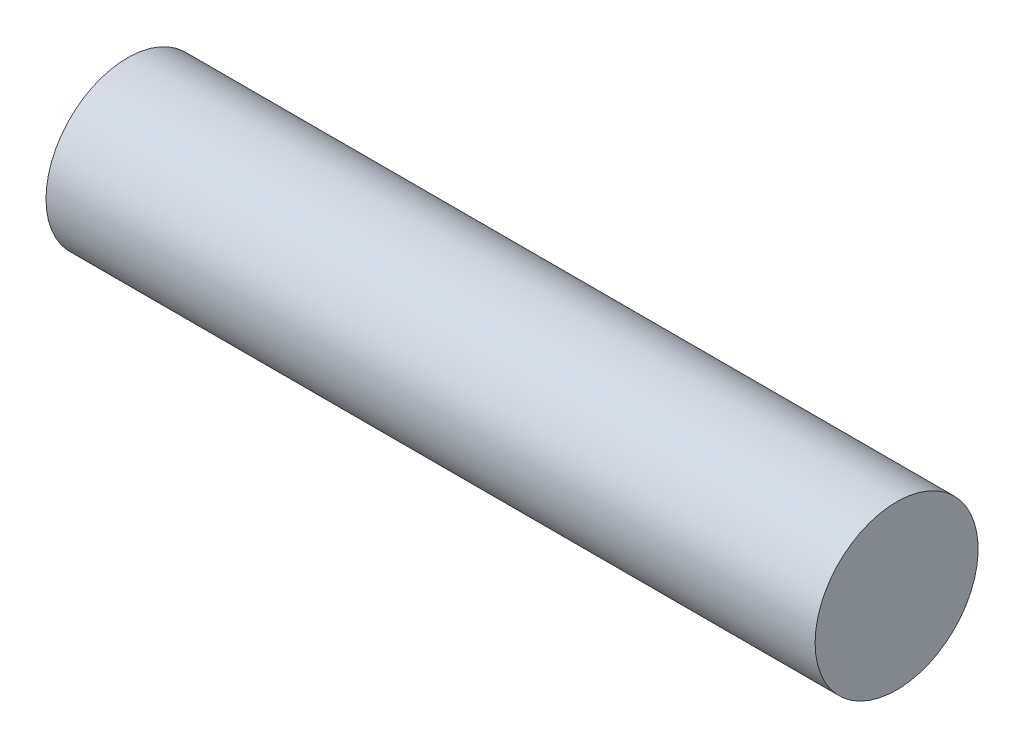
ISO-10303-21;
HEADER;
FILE_DESCRIPTION(('STEP AP214'),'2;1');
FILE_NAME('part.step','',(''),(''),'','','');
FILE_SCHEMA(('AUTOMOTIVE_DESIGN { 1 0 10303 214 1 1 1 1 }'));
ENDSEC;
DATA;
#1=APPLICATION_CONTEXT('core data for automotive mechanical design processes');
#2=APPLICATION_PROTOCOL_DEFINITION('international standard','automotive_design',2000,#1);
#3=PRODUCT_CONTEXT('',#1,'mechanical');
#4=PRODUCT('Part','Part','',(#3));
#5=PRODUCT_RELATED_PRODUCT_CATEGORY('part','',(#4));
#6=PRODUCT_DEFINITION_FORMATION('','',#4);
#7=PRODUCT_DEFINITION_CONTEXT('part definition',#1,'design');
#8=PRODUCT_DEFINITION('design','',#6,#7);
#9=PRODUCT_DEFINITION_SHAPE('','',#8);
#10=(LENGTH_UNIT() NAMED_UNIT(*) SI_UNIT(.MILLI.,.METRE.));
#11=(NAMED_UNIT(*) PLANE_ANGLE_UNIT() SI_UNIT($,.RADIAN.));
#12=(NAMED_UNIT(*) SI_UNIT($,.STERADIAN.) SOLID_ANGLE_UNIT());
#13=UNCERTAINTY_MEASURE_WITH_UNIT(LENGTH_MEASURE(1.E-05),#10,'distance_accuracy_value','');
#14=(GEOMETRIC_REPRESENTATION_CONTEXT(3) GLOBAL_UNCERTAINTY_ASSIGNED_CONTEXT((#13)) GLOBAL_UNIT_ASSIGNED_CONTEXT((#10,
#11,#12)) REPRESENTATION_CONTEXT('',''));
#15=CARTESIAN_POINT('',(0.,0.,0.));
#16=DIRECTION('',(0.,0.,1.));
#17=DIRECTION('',(1.,0.,0.));
#18=AXIS2_PLACEMENT_3D('',#15,#16,#17);
#19=CARTESIAN_POINT('',(15.875,-0.18357272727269,0.));
#20=DIRECTION('',(1.,0.,0.));
#21=DIRECTION('',(0.,0.,-1.));
#22=AXIS2_PLACEMENT_3D('',#19,#20,#21);
#23=PLANE('',#22);
#24=CARTESIAN_POINT('',(15.875,0.,0.));
#25=DIRECTION('',(-1.,0.,0.));
#26=DIRECTION('',(0.,0.,1.));
#27=AXIS2_PLACEMENT_3D('',#24,#25,#26);
#28=CIRCLE('',#27,2.0193);
#29=CARTESIAN_POINT('',(15.875,0.,2.0193));
#30=VERTEX_POINT('',#29);
#31=EDGE_CURVE('E17',#30,#30,#28,.T.);
#32=ORIENTED_EDGE('',*,*,#31,.F.);
#33=EDGE_LOOP('',(#32));
#34=FACE_BOUND('',#33,.T.);
#35=ADVANCED_FACE('F13',(#34),#23,.T.);
#36=CARTESIAN_POINT('',(-3.17500000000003,-0.18357272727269,0.));
#37=DIRECTION('',(1.,0.,0.));
#38=DIRECTION('',(0.,0.,-1.));
#39=AXIS2_PLACEMENT_3D('',#36,#37,#38);
#40=PLANE('',#39);
#41=CARTESIAN_POINT('',(-3.17499999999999,0.,0.));
#42=DIRECTION('',(-1.,0.,0.));
#43=DIRECTION('',(0.,0.,1.));
#44=AXIS2_PLACEMENT_3D('',#41,#42,#43);
#45=CIRCLE('',#44,2.0193);
#46=CARTESIAN_POINT('',(-3.17499999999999,0.,2.0193));
#47=VERTEX_POINT('',#46);
#48=EDGE_CURVE('E9',#47,#47,#45,.F.);
#49=ORIENTED_EDGE('',*,*,#48,.F.);
#50=EDGE_LOOP('',(#49));
#51=FACE_BOUND('',#50,.T.);
#52=ADVANCED_FACE('F28',(#51),#40,.F.);
#53=CARTESIAN_POINT('',(15.875,0.,0.));
#54=DIRECTION('',(-1.,0.,0.));
#55=DIRECTION('',(0.,0.,1.));
#56=AXIS2_PLACEMENT_3D('',#53,#54,#55);
#57=CYLINDRICAL_SURFACE('',#56,2.0193);
#58=ORIENTED_EDGE('',*,*,#31,.T.);
#59=EDGE_LOOP('',(#58));
#60=FACE_BOUND('',#59,.T.);
#61=ORIENTED_EDGE('',*,*,#48,.T.);
#62=EDGE_LOOP('',(#61));
#63=FACE_BOUND('',#62,.T.);
#64=ADVANCED_FACE('F15',(#60,#63),#57,.T.);
#65=CLOSED_SHELL('',(#35,#52,#64));
#66=MANIFOLD_SOLID_BREP('B1',#65);
#67=ADVANCED_BREP_SHAPE_REPRESENTATION('',(#18,#66),#14);
#68=SHAPE_DEFINITION_REPRESENTATION(#9,#67);
ENDSEC;
END-ISO-10303-21;
